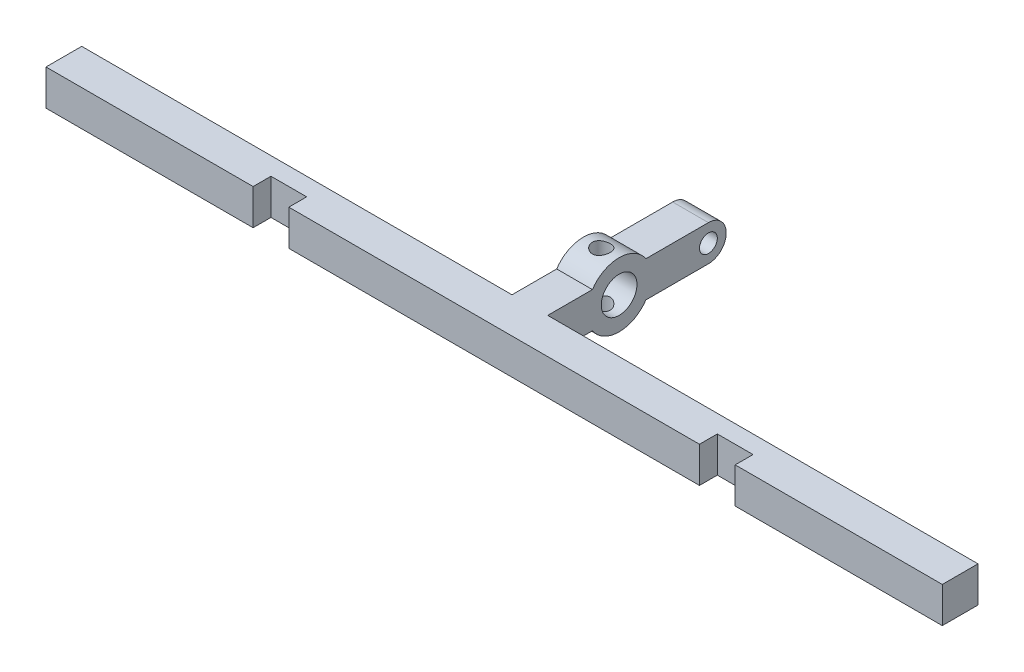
ISO-10303-21;
HEADER;
FILE_DESCRIPTION(('STEP AP214'),'2;1');
FILE_NAME('part.step','',(''),(''),'','','');
FILE_SCHEMA(('AUTOMOTIVE_DESIGN { 1 0 10303 214 1 1 1 1 }'));
ENDSEC;
DATA;
#1=APPLICATION_CONTEXT('core data for automotive mechanical design processes');
#2=APPLICATION_PROTOCOL_DEFINITION('international standard','automotive_design',2000,#1);
#3=PRODUCT_CONTEXT('',#1,'mechanical');
#4=PRODUCT('Part','Part','',(#3));
#5=PRODUCT_RELATED_PRODUCT_CATEGORY('part','',(#4));
#6=PRODUCT_DEFINITION_FORMATION('','',#4);
#7=PRODUCT_DEFINITION_CONTEXT('part definition',#1,'design');
#8=PRODUCT_DEFINITION('design','',#6,#7);
#9=PRODUCT_DEFINITION_SHAPE('','',#8);
#10=(LENGTH_UNIT() NAMED_UNIT(*) SI_UNIT(.MILLI.,.METRE.));
#11=(NAMED_UNIT(*) PLANE_ANGLE_UNIT() SI_UNIT($,.RADIAN.));
#12=(NAMED_UNIT(*) SI_UNIT($,.STERADIAN.) SOLID_ANGLE_UNIT());
#13=UNCERTAINTY_MEASURE_WITH_UNIT(LENGTH_MEASURE(1.E-05),#10,'distance_accuracy_value','');
#14=(GEOMETRIC_REPRESENTATION_CONTEXT(3) GLOBAL_UNCERTAINTY_ASSIGNED_CONTEXT((#13)) GLOBAL_UNIT_ASSIGNED_CONTEXT((#10,
#11,#12)) REPRESENTATION_CONTEXT('',''));
#15=CARTESIAN_POINT('',(0.,0.,0.));
#16=DIRECTION('',(0.,0.,1.));
#17=DIRECTION('',(1.,0.,0.));
#18=AXIS2_PLACEMENT_3D('',#15,#16,#17);
#19=CARTESIAN_POINT('',(-95.0441558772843,4.99999999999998,-20.));
#20=DIRECTION('',(-1.,0.,0.));
#21=DIRECTION('',(0.,0.,1.));
#22=AXIS2_PLACEMENT_3D('',#19,#20,#21);
#23=CYLINDRICAL_SURFACE('',#22,9.);
#24=CARTESIAN_POINT('',(-125.5,-3.64580823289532,-22.5));
#25=CARTESIAN_POINT('',(-125.36251304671,-3.64581037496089,-22.4999971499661));
#26=CARTESIAN_POINT('',(-125.224996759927,-3.64912360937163,-22.4886197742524));
#27=CARTESIAN_POINT('',(-124.953951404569,-3.66197474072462,-22.4435069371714));
#28=CARTESIAN_POINT('',(-124.820424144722,-3.67151541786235,-22.4097614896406));
#29=CARTESIAN_POINT('',(-124.561317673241,-3.6956593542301,-22.3211200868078));
#30=CARTESIAN_POINT('',(-124.435726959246,-3.71025507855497,-22.2662555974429));
#31=CARTESIAN_POINT('',(-124.195509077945,-3.74285475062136,-22.1370337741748));
#32=CARTESIAN_POINT('',(-124.080883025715,-3.760859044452,-22.0626744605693));
#33=CARTESIAN_POINT('',(-123.862738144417,-3.79879482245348,-21.8944153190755));
#34=CARTESIAN_POINT('',(-123.759560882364,-3.81876275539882,-21.8000807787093));
#35=CARTESIAN_POINT('',(-123.570269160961,-3.8580623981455,-21.5954828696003));
#36=CARTESIAN_POINT('',(-123.484156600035,-3.87739403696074,-21.4852177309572));
#37=CARTESIAN_POINT('',(-123.329995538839,-3.91365202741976,-21.249500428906));
#38=CARTESIAN_POINT('',(-123.262289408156,-3.93053038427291,-21.1238163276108));
#39=CARTESIAN_POINT('',(-123.14910072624,-3.95956018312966,-20.8623003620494));
#40=CARTESIAN_POINT('',(-123.103614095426,-3.97171249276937,-20.7264703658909));
#41=CARTESIAN_POINT('',(-123.037269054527,-3.98966318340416,-20.4520863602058));
#42=CARTESIAN_POINT('',(-123.015828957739,-3.99561138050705,-20.313682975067));
#43=CARTESIAN_POINT('',(-122.996352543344,-4.00100867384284,-20.0351244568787));
#44=CARTESIAN_POINT('',(-122.998311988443,-4.00045894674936,-19.8949696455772));
#45=CARTESIAN_POINT('',(-123.025175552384,-3.99303086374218,-19.6209457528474));
#46=CARTESIAN_POINT('',(-123.049450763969,-3.98632598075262,-19.4870095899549));
#47=CARTESIAN_POINT('',(-123.119237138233,-3.96754760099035,-19.2251925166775));
#48=CARTESIAN_POINT('',(-123.164749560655,-3.95547378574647,-19.0973119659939));
#49=CARTESIAN_POINT('',(-123.276182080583,-3.92706250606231,-18.8496664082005));
#50=CARTESIAN_POINT('',(-123.342311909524,-3.91068150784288,-18.7300009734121));
#51=CARTESIAN_POINT('',(-123.49293961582,-3.87541221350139,-18.5032554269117));
#52=CARTESIAN_POINT('',(-123.577441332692,-3.85652339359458,-18.3961779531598));
#53=CARTESIAN_POINT('',(-123.765728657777,-3.81753663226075,-18.1938932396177));
#54=CARTESIAN_POINT('',(-123.870061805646,-3.79741936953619,-18.0991987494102));
#55=CARTESIAN_POINT('',(-124.093332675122,-3.75880383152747,-17.9285189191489));
#56=CARTESIAN_POINT('',(-124.212271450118,-3.74030567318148,-17.8525349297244));
#57=CARTESIAN_POINT('',(-124.462564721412,-3.70694013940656,-17.7209976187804));
#58=CARTESIAN_POINT('',(-124.594002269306,-3.69209980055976,-17.6655949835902));
#59=CARTESIAN_POINT('',(-124.864843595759,-3.6680602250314,-17.5778470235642));
#60=CARTESIAN_POINT('',(-125.00424519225,-3.65885945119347,-17.5454954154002));
#61=CARTESIAN_POINT('',(-125.282234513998,-3.64747148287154,-17.5056754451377));
#62=CARTESIAN_POINT('',(-125.420703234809,-3.64506746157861,-17.4974375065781));
#63=CARTESIAN_POINT('',(-125.697041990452,-3.64694988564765,-17.5039490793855));
#64=CARTESIAN_POINT('',(-125.83491209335,-3.65123554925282,-17.5186959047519));
#65=CARTESIAN_POINT('',(-126.103097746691,-3.66580389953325,-17.5700775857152));
#66=CARTESIAN_POINT('',(-126.233511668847,-3.67595686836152,-17.6062394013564));
#67=CARTESIAN_POINT('',(-126.486420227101,-3.70098664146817,-17.6988874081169));
#68=CARTESIAN_POINT('',(-126.60891376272,-3.7158641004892,-17.7553764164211));
#69=CARTESIAN_POINT('',(-126.845695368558,-3.74910362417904,-17.8886042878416));
#70=CARTESIAN_POINT('',(-126.959721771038,-3.76753959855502,-17.9657893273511));
#71=CARTESIAN_POINT('',(-127.173486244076,-3.80564999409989,-18.1376727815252));
#72=CARTESIAN_POINT('',(-127.273221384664,-3.82532466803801,-18.2323747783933));
#73=CARTESIAN_POINT('',(-127.458821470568,-3.86445019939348,-18.4401825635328));
#74=CARTESIAN_POINT('',(-127.544146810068,-3.88387421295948,-18.5537764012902));
#75=CARTESIAN_POINT('',(-127.694523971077,-3.91967402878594,-18.7941168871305));
#76=CARTESIAN_POINT('',(-127.759576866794,-3.93604999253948,-18.9208628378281));
#77=CARTESIAN_POINT('',(-127.866949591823,-3.96380327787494,-19.1830216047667));
#78=CARTESIAN_POINT('',(-127.909441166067,-3.97521823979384,-19.3183598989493));
#79=CARTESIAN_POINT('',(-127.970968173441,-3.99192942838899,-19.5946236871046));
#80=CARTESIAN_POINT('',(-127.990009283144,-3.99722713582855,-19.7355478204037));
#81=CARTESIAN_POINT('',(-128.003714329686,-4.00103042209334,-20.0139601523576));
#82=CARTESIAN_POINT('',(-127.999166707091,-3.99975568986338,-20.1514070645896));
#83=CARTESIAN_POINT('',(-127.967671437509,-3.99106088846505,-20.4235006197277));
#84=CARTESIAN_POINT('',(-127.94072476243,-3.98364108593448,-20.5581473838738));
#85=CARTESIAN_POINT('',(-127.865656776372,-3.96353984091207,-20.8197849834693));
#86=CARTESIAN_POINT('',(-127.817707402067,-3.95090116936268,-20.9468286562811));
#87=CARTESIAN_POINT('',(-127.702148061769,-3.92167820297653,-21.1911392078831));
#88=CARTESIAN_POINT('',(-127.634535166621,-3.90509332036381,-21.3084046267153));
#89=CARTESIAN_POINT('',(-127.479328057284,-3.8691539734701,-21.533451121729));
#90=CARTESIAN_POINT('',(-127.391219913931,-3.84973411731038,-21.6408672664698));
#91=CARTESIAN_POINT('',(-127.198482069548,-3.81055920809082,-21.8396556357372));
#92=CARTESIAN_POINT('',(-127.093847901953,-3.79080406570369,-21.931023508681));
#93=CARTESIAN_POINT('',(-126.867955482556,-3.75263553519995,-22.097342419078));
#94=CARTESIAN_POINT('',(-126.746353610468,-3.73426670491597,-22.1718379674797));
#95=CARTESIAN_POINT('',(-126.491856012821,-3.70160385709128,-22.2992265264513));
#96=CARTESIAN_POINT('',(-126.35896712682,-3.68730739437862,-22.3521325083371));
#97=CARTESIAN_POINT('',(-126.105639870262,-3.66621345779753,-22.4285949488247));
#98=CARTESIAN_POINT('',(-125.986210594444,-3.65862660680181,-22.4553056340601));
#99=CARTESIAN_POINT('',(-125.744528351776,-3.64842338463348,-22.4910082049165));
#100=CARTESIAN_POINT('',(-125.622275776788,-3.64580632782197,-22.5000025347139));
#101=CARTESIAN_POINT('',(-125.5,-3.64580823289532,-22.5));
#102=B_SPLINE_CURVE_WITH_KNOTS('',3,(#24,#25,#26,#27,#28,#29,#30,#31,#32,#33,#34,#35,#36,#37,
#38,#39,#40,#41,#42,#43,#44,#45,#46,#47,#48,#49,#50,#51,#52,#53,#54,#55,#56,#57,#58,#59,#60,#61,
#62,#63,#64,#65,#66,#67,#68,#69,#70,#71,#72,#73,#74,#75,#76,#77,#78,#79,#80,#81,#82,#83,#84,#85,
#86,#87,#88,#89,#90,#91,#92,#93,#94,#95,#96,#97,#98,#99,#100,#101),.UNSPECIFIED.,.T.,.F.,(4,2,2,
2,2,2,2,2,2,2,2,2,2,2,2,2,2,2,2,2,2,2,2,2,2,2,2,2,2,2,2,2,2,2,2,2,2,2,4),(0.,0.412010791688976,
0.82420564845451,1.23578872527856,1.64741361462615,2.06913895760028,2.49091119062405,
2.92006196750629,3.34913392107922,3.76758631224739,4.1859629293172,4.5928986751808,
4.99985856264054,5.41110133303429,5.82243013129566,6.24742875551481,6.67245804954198,
7.10054057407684,7.52850636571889,7.94265637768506,8.35675799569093,8.76203677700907,
9.1673717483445,9.58226667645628,9.99724654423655,10.4253750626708,10.8534808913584,
11.2782793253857,11.7029749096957,12.1135686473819,12.5241445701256,12.9314203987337,
13.3387569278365,13.7576868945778,14.1767302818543,14.6060087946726,15.0350290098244,
15.4015066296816,15.767933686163),.UNSPECIFIED.);
#103=CARTESIAN_POINT('',(-125.5,-3.64580823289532,-22.5));
#104=VERTEX_POINT('',#103);
#105=EDGE_CURVE('E372',#104,#104,#102,.T.);
#106=ORIENTED_EDGE('',*,*,#105,.F.);
#107=EDGE_LOOP('',(#106));
#108=FACE_BOUND('',#107,.T.);
#109=CARTESIAN_POINT('',(-130.5,4.99999999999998,-20.));
#110=DIRECTION('',(-1.,0.,0.));
#111=DIRECTION('',(0.,0.,1.));
#112=AXIS2_PLACEMENT_3D('',#109,#110,#111);
#113=CIRCLE('',#112,9.);
#114=CARTESIAN_POINT('',(-130.5,0.,-27.4833147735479));
#115=VERTEX_POINT('',#114);
#116=CARTESIAN_POINT('',(-130.5,0.,-12.5166852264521));
#117=VERTEX_POINT('',#116);
#118=EDGE_CURVE('E211',#115,#117,#113,.T.);
#119=ORIENTED_EDGE('',*,*,#118,.F.);
#120=DIRECTION('',(-1.,0.,0.));
#121=VECTOR('',#120,1.);
#122=CARTESIAN_POINT('',(-95.0441558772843,0.,-27.4833147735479));
#123=LINE('',#122,#121);
#124=CARTESIAN_POINT('',(-120.5,0.,-27.4833147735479));
#125=VERTEX_POINT('',#124);
#126=EDGE_CURVE('E200',#115,#125,#123,.F.);
#127=ORIENTED_EDGE('',*,*,#126,.T.);
#128=CARTESIAN_POINT('',(-120.5,4.99999999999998,-20.));
#129=DIRECTION('',(-1.,0.,0.));
#130=DIRECTION('',(0.,-1.,0.));
#131=AXIS2_PLACEMENT_3D('',#128,#129,#130);
#132=CIRCLE('',#131,9.);
#133=CARTESIAN_POINT('',(-120.5,0.,-12.5166852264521));
#134=VERTEX_POINT('',#133);
#135=EDGE_CURVE('E206',#134,#125,#132,.F.);
#136=ORIENTED_EDGE('',*,*,#135,.F.);
#137=DIRECTION('',(-1.,0.,0.));
#138=VECTOR('',#137,1.);
#139=CARTESIAN_POINT('',(-95.0441558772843,0.,-12.5166852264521));
#140=LINE('',#139,#138);
#141=EDGE_CURVE('E210',#117,#134,#140,.F.);
#142=ORIENTED_EDGE('',*,*,#141,.F.);
#143=EDGE_LOOP('',(#119,#127,#136,#142));
#144=FACE_BOUND('',#143,.T.);
#145=ADVANCED_FACE('F41',(#108,#144),#23,.T.);
#146=CARTESIAN_POINT('',(-128.,14.0000000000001,-20.0000000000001));
#147=CARTESIAN_POINT('',(-127.99999720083,13.9999981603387,-19.8623974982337));
#148=CARTESIAN_POINT('',(-127.988601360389,13.9968134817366,-19.7247657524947));
#149=CARTESIAN_POINT('',(-127.943408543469,13.9844190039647,-19.4534810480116));
#150=CARTESIAN_POINT('',(-127.909602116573,13.9752066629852,-19.3198297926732));
#151=CARTESIAN_POINT('',(-127.820782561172,13.9517713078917,-19.0604601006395));
#152=CARTESIAN_POINT('',(-127.765798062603,13.9375550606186,-18.9347312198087));
#153=CARTESIAN_POINT('',(-127.636292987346,13.9056062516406,-18.6942786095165));
#154=CARTESIAN_POINT('',(-127.561770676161,13.8878733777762,-18.5795558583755));
#155=CARTESIAN_POINT('',(-127.393341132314,13.8503031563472,-18.3615064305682));
#156=CARTESIAN_POINT('',(-127.299035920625,13.8304274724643,-18.2584937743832));
#157=CARTESIAN_POINT('',(-127.094567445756,13.7910521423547,-18.0695236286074));
#158=CARTESIAN_POINT('',(-126.984401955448,13.7715525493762,-17.9835685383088));
#159=CARTESIAN_POINT('',(-126.748785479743,13.7347408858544,-17.8295838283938));
#160=CARTESIAN_POINT('',(-126.623085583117,13.717476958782,-17.761922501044));
#161=CARTESIAN_POINT('',(-126.361536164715,13.6876580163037,-17.6488208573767));
#162=CARTESIAN_POINT('',(-126.225688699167,13.675102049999,-17.603376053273));
#163=CARTESIAN_POINT('',(-125.951194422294,13.6565176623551,-17.5371015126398));
#164=CARTESIAN_POINT('',(-125.812696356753,13.6503377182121,-17.515699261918));
#165=CARTESIAN_POINT('',(-125.533948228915,13.644752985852,-17.4963314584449));
#166=CARTESIAN_POINT('',(-125.393698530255,13.645346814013,-17.4983611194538));
#167=CARTESIAN_POINT('',(-125.119955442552,13.6531073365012,-17.5253465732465));
#168=CARTESIAN_POINT('',(-124.986386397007,13.6600732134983,-17.5496019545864));
#169=CARTESIAN_POINT('',(-124.725292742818,13.6794703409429,-17.6192253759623));
#170=CARTESIAN_POINT('',(-124.597768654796,13.6919020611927,-17.664595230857));
#171=CARTESIAN_POINT('',(-124.350595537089,13.7210013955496,-17.7757125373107));
#172=CARTESIAN_POINT('',(-124.23106026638,13.7377183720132,-17.8416995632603));
#173=CARTESIAN_POINT('',(-124.004516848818,13.7734790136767,-17.9920111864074));
#174=CARTESIAN_POINT('',(-123.897511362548,13.7925231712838,-18.0763396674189));
#175=CARTESIAN_POINT('',(-123.695072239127,13.8316214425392,-18.2644887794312));
#176=CARTESIAN_POINT('',(-123.60018473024,13.8516874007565,-18.3688954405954));
#177=CARTESIAN_POINT('',(-123.429148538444,13.8899639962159,-18.592386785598));
#178=CARTESIAN_POINT('',(-123.353000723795,13.908174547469,-18.7114721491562));
#179=CARTESIAN_POINT('',(-123.22133636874,13.9408167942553,-18.9618331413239));
#180=CARTESIAN_POINT('',(-123.165925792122,13.9552289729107,-19.0931672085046));
#181=CARTESIAN_POINT('',(-123.078131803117,13.9785098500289,-19.3637800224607));
#182=CARTESIAN_POINT('',(-123.045742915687,13.987379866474,-19.5030568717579));
#183=CARTESIAN_POINT('',(-123.005785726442,13.9983747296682,-19.7809467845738));
#184=CARTESIAN_POINT('',(-122.997475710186,14.0007010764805,-19.9194453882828));
#185=CARTESIAN_POINT('',(-123.003853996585,13.9989296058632,-20.1958598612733));
#186=CARTESIAN_POINT('',(-123.018539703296,13.9948325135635,-20.3337757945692));
#187=CARTESIAN_POINT('',(-123.069886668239,13.9808053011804,-20.6024138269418));
#188=CARTESIAN_POINT('',(-123.106127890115,13.970986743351,-20.7332225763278));
#189=CARTESIAN_POINT('',(-123.199063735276,13.9466365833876,-20.9868862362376));
#190=CARTESIAN_POINT('',(-123.255760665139,13.9321044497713,-21.1097402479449));
#191=CARTESIAN_POINT('',(-123.389331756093,13.8994748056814,-21.3468402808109));
#192=CARTESIAN_POINT('',(-123.466601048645,13.8813094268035,-21.460854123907));
#193=CARTESIAN_POINT('',(-123.638632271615,13.843509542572,-21.6745553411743));
#194=CARTESIAN_POINT('',(-123.733397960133,13.8238747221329,-21.7742396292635));
#195=CARTESIAN_POINT('',(-123.941202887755,13.7845968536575,-21.9596240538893));
#196=CARTESIAN_POINT('',(-124.054714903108,13.7649721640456,-22.0447991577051));
#197=CARTESIAN_POINT('',(-124.294841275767,13.7285938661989,-22.1949116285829));
#198=CARTESIAN_POINT('',(-124.421455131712,13.7118401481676,-22.2598497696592));
#199=CARTESIAN_POINT('',(-124.683614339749,13.6832959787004,-22.3671621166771));
#200=CARTESIAN_POINT('',(-124.819105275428,13.6714780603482,-22.4096615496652));
#201=CARTESIAN_POINT('',(-125.095699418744,13.6541575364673,-22.4711530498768));
#202=CARTESIAN_POINT('',(-125.236801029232,13.6486531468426,-22.4901517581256));
#203=CARTESIAN_POINT('',(-125.515211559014,13.6447407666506,-22.5036971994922));
#204=CARTESIAN_POINT('',(-125.652476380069,13.646086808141,-22.4990914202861));
#205=CARTESIAN_POINT('',(-125.924189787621,13.6551427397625,-22.4675428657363));
#206=CARTESIAN_POINT('',(-126.058638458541,13.6628524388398,-22.4406007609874));
#207=CARTESIAN_POINT('',(-126.319734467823,13.6836143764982,-22.3656544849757));
#208=CARTESIAN_POINT('',(-126.446441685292,13.6966173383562,-22.3178442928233));
#209=CARTESIAN_POINT('',(-126.690134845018,13.7264983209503,-22.2026690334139));
#210=CARTESIAN_POINT('',(-126.807119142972,13.7433769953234,-22.1353006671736));
#211=CARTESIAN_POINT('',(-127.032055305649,13.779776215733,-21.9804139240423));
#212=CARTESIAN_POINT('',(-127.139602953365,13.799363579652,-21.8923241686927));
#213=CARTESIAN_POINT('',(-127.338664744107,13.8386166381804,-21.6995630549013));
#214=CARTESIAN_POINT('',(-127.430174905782,13.8582823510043,-21.5948875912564));
#215=CARTESIAN_POINT('',(-127.596716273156,13.8960367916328,-21.3689204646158));
#216=CARTESIAN_POINT('',(-127.671303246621,13.9140768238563,-21.2472925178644));
#217=CARTESIAN_POINT('',(-127.798856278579,13.9459994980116,-20.9927239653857));
#218=CARTESIAN_POINT('',(-127.851835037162,13.9598845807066,-20.8597900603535));
#219=CARTESIAN_POINT('',(-127.928440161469,13.9803214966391,-20.6062909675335));
#220=CARTESIAN_POINT('',(-127.955209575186,13.9876449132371,-20.4867288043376));
#221=CARTESIAN_POINT('',(-127.990989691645,13.9974846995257,-20.2447852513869));
#222=CARTESIAN_POINT('',(-128.00000249,14.0000016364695,-20.1224041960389));
#223=CARTESIAN_POINT('',(-128.,14.0000000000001,-20.0000000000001));
#224=B_SPLINE_CURVE_WITH_KNOTS('',3,(#146,#147,#148,#149,#150,#151,#152,#153,#154,#155,#156,
#157,#158,#159,#160,#161,#162,#163,#164,#165,#166,#167,#168,#169,#170,#171,#172,#173,#174,#175,
#176,#177,#178,#179,#180,#181,#182,#183,#184,#185,#186,#187,#188,#189,#190,#191,#192,#193,#194,
#195,#196,#197,#198,#199,#200,#201,#202,#203,#204,#205,#206,#207,#208,#209,#210,#211,#212,#213,
#214,#215,#216,#217,#218,#219,#220,#221,#222,#223),.UNSPECIFIED.,.T.,.F.,(4,2,2,2,2,2,2,2,2,2,2,
2,2,2,2,2,2,2,2,2,2,2,2,2,2,2,2,2,2,2,2,2,2,2,2,2,2,2,4),(0.,0.412358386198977,
0.824890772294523,1.23686741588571,1.64888064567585,2.0701524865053,2.49148354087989,
2.92075380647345,3.34993732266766,3.76866863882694,4.18731442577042,4.59320465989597,
4.99912978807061,5.40995920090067,5.82087569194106,6.24638987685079,6.67192377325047,
7.09960331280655,7.5271811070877,7.94144021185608,8.3556525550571,8.76204634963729,
9.16848598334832,9.58337897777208,9.99836119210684,10.4261198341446,10.8538621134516,
11.279191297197,11.7044002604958,12.114451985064,12.5244913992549,12.9307978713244,
13.3371729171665,13.7564382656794,14.1758075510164,14.6051618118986,15.0342633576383,
15.4011197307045,15.7679328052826),.UNSPECIFIED.);
#225=CARTESIAN_POINT('',(-128.,14.0000000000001,-20.0000000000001));
#226=VERTEX_POINT('',#225);
#227=EDGE_CURVE('E365',#226,#226,#224,.T.);
#228=ORIENTED_EDGE('',*,*,#227,.F.);
#229=EDGE_LOOP('',(#228));
#230=FACE_BOUND('',#229,.T.);
#231=CARTESIAN_POINT('',(-120.5,9.99999999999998,-27.4833147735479));
#232=VERTEX_POINT('',#231);
#233=CARTESIAN_POINT('',(-120.5,9.99999999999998,-12.5166852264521));
#234=VERTEX_POINT('',#233);
#235=EDGE_CURVE('E188',#232,#234,#132,.F.);
#236=ORIENTED_EDGE('',*,*,#235,.F.);
#237=DIRECTION('',(-1.,0.,0.));
#238=VECTOR('',#237,1.);
#239=CARTESIAN_POINT('',(-95.0441558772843,9.99999999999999,-27.4833147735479));
#240=LINE('',#239,#238);
#241=CARTESIAN_POINT('',(-130.5,9.99999999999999,-27.4833147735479));
#242=VERTEX_POINT('',#241);
#243=EDGE_CURVE('E196',#232,#242,#240,.T.);
#244=ORIENTED_EDGE('',*,*,#243,.T.);
#245=CARTESIAN_POINT('',(-130.5,9.99999999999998,-12.5166852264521));
#246=VERTEX_POINT('',#245);
#247=EDGE_CURVE('E207',#246,#242,#113,.T.);
#248=ORIENTED_EDGE('',*,*,#247,.F.);
#249=DIRECTION('',(-1.,0.,0.));
#250=VECTOR('',#249,1.);
#251=CARTESIAN_POINT('',(-95.0441558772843,9.99999999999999,-12.5166852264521));
#252=LINE('',#251,#250);
#253=EDGE_CURVE('E201',#234,#246,#252,.T.);
#254=ORIENTED_EDGE('',*,*,#253,.F.);
#255=EDGE_LOOP('',(#236,#244,#248,#254));
#256=FACE_BOUND('',#255,.T.);
#257=ADVANCED_FACE('F203',(#230,#256),#23,.T.);
#258=CARTESIAN_POINT('',(0.,0.,10.));
#259=DIRECTION('',(0.,1.,0.));
#260=DIRECTION('',(-1.,0.,0.));
#261=AXIS2_PLACEMENT_3D('',#258,#259,#260);
#262=PLANE('',#261);
#263=DIRECTION('',(0.,0.,1.));
#264=VECTOR('',#263,1.);
#265=CARTESIAN_POINT('',(-130.5,0.,-40.));
#266=LINE('',#265,#264);
#267=CARTESIAN_POINT('',(-130.5,0.,0.));
#268=VERTEX_POINT('',#267);
#269=EDGE_CURVE('E245',#117,#268,#266,.T.);
#270=ORIENTED_EDGE('',*,*,#269,.F.);
#271=ORIENTED_EDGE('',*,*,#141,.T.);
#272=DIRECTION('',(0.,0.,1.));
#273=VECTOR('',#272,1.);
#274=CARTESIAN_POINT('',(-120.5,0.,-40.));
#275=LINE('',#274,#273);
#276=CARTESIAN_POINT('',(-120.5,0.,0.));
#277=VERTEX_POINT('',#276);
#278=EDGE_CURVE('E217',#134,#277,#275,.T.);
#279=ORIENTED_EDGE('',*,*,#278,.T.);
#280=DIRECTION('',(1.,0.,0.));
#281=VECTOR('',#280,1.);
#282=CARTESIAN_POINT('',(0.,0.,0.));
#283=LINE('',#282,#281);
#284=CARTESIAN_POINT('',(0.,0.,0.));
#285=VERTEX_POINT('',#284);
#286=EDGE_CURVE('E246',#277,#285,#283,.T.);
#287=ORIENTED_EDGE('',*,*,#286,.T.);
#288=DIRECTION('',(0.,0.,-1.));
#289=VECTOR('',#288,1.);
#290=CARTESIAN_POINT('',(0.,0.,10.));
#291=LINE('',#290,#289);
#292=CARTESIAN_POINT('',(0.,0.,10.));
#293=VERTEX_POINT('',#292);
#294=EDGE_CURVE('E238',#293,#285,#291,.T.);
#295=ORIENTED_EDGE('',*,*,#294,.F.);
#296=DIRECTION('',(1.,0.,0.));
#297=VECTOR('',#296,1.);
#298=CARTESIAN_POINT('',(0.,0.,10.));
#299=LINE('',#298,#297);
#300=CARTESIAN_POINT('',(-58.,0.,10.));
#301=VERTEX_POINT('',#300);
#302=EDGE_CURVE('E257',#301,#293,#299,.T.);
#303=ORIENTED_EDGE('',*,*,#302,.F.);
#304=DIRECTION('',(0.,0.,1.));
#305=VECTOR('',#304,1.);
#306=CARTESIAN_POINT('',(-58.,0.,5.));
#307=LINE('',#306,#305);
#308=CARTESIAN_POINT('',(-58.,0.,5.));
#309=VERTEX_POINT('',#308);
#310=EDGE_CURVE('E277',#309,#301,#307,.T.);
#311=ORIENTED_EDGE('',*,*,#310,.F.);
#312=DIRECTION('',(1.,0.,0.));
#313=VECTOR('',#312,1.);
#314=CARTESIAN_POINT('',(-58.,0.,5.));
#315=LINE('',#314,#313);
#316=CARTESIAN_POINT('',(-68.,0.,5.));
#317=VERTEX_POINT('',#316);
#318=EDGE_CURVE('E282',#317,#309,#315,.T.);
#319=ORIENTED_EDGE('',*,*,#318,.F.);
#320=DIRECTION('',(0.,0.,1.));
#321=VECTOR('',#320,1.);
#322=CARTESIAN_POINT('',(-68.,0.,5.));
#323=LINE('',#322,#321);
#324=CARTESIAN_POINT('',(-68.,0.,10.));
#325=VERTEX_POINT('',#324);
#326=EDGE_CURVE('E274',#317,#325,#323,.T.);
#327=ORIENTED_EDGE('',*,*,#326,.T.);
#328=CARTESIAN_POINT('',(-183.,0.,10.));
#329=VERTEX_POINT('',#328);
#330=EDGE_CURVE('E231',#329,#325,#299,.T.);
#331=ORIENTED_EDGE('',*,*,#330,.F.);
#332=DIRECTION('',(0.,0.,1.));
#333=VECTOR('',#332,1.);
#334=CARTESIAN_POINT('',(-183.,0.,5.));
#335=LINE('',#334,#333);
#336=CARTESIAN_POINT('',(-183.,0.,5.));
#337=VERTEX_POINT('',#336);
#338=EDGE_CURVE('E296',#337,#329,#335,.T.);
#339=ORIENTED_EDGE('',*,*,#338,.F.);
#340=DIRECTION('',(1.,0.,0.));
#341=VECTOR('',#340,1.);
#342=CARTESIAN_POINT('',(-193.,0.,5.));
#343=LINE('',#342,#341);
#344=CARTESIAN_POINT('',(-193.,0.,5.));
#345=VERTEX_POINT('',#344);
#346=EDGE_CURVE('E313',#345,#337,#343,.T.);
#347=ORIENTED_EDGE('',*,*,#346,.F.);
#348=DIRECTION('',(0.,0.,1.));
#349=VECTOR('',#348,1.);
#350=CARTESIAN_POINT('',(-193.,0.,5.));
#351=LINE('',#350,#349);
#352=CARTESIAN_POINT('',(-193.,0.,10.));
#353=VERTEX_POINT('',#352);
#354=EDGE_CURVE('E237',#345,#353,#351,.T.);
#355=ORIENTED_EDGE('',*,*,#354,.T.);
#356=CARTESIAN_POINT('',(-251.,0.,10.));
#357=VERTEX_POINT('',#356);
#358=EDGE_CURVE('E254',#357,#353,#299,.T.);
#359=ORIENTED_EDGE('',*,*,#358,.F.);
#360=DIRECTION('',(0.,0.,-1.));
#361=VECTOR('',#360,1.);
#362=CARTESIAN_POINT('',(-251.,0.,10.));
#363=LINE('',#362,#361);
#364=CARTESIAN_POINT('',(-251.,0.,0.));
#365=VERTEX_POINT('',#364);
#366=EDGE_CURVE('E233',#357,#365,#363,.T.);
#367=ORIENTED_EDGE('',*,*,#366,.T.);
#368=EDGE_CURVE('E236',#365,#268,#283,.T.);
#369=ORIENTED_EDGE('',*,*,#368,.T.);
#370=EDGE_LOOP('',(#270,#271,#279,#287,#295,#303,#311,#319,#327,#331,#339,#347,#355,#359,#367,#369));
#371=FACE_BOUND('',#370,.T.);
#372=ADVANCED_FACE('F431',(#371),#262,.F.);
#373=CARTESIAN_POINT('',(-130.5,0.,-40.));
#374=DIRECTION('',(1.,0.,0.));
#375=DIRECTION('',(0.,0.,-1.));
#376=AXIS2_PLACEMENT_3D('',#373,#374,#375);
#377=PLANE('',#376);
#378=CARTESIAN_POINT('',(-130.5,4.99999999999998,-20.));
#379=DIRECTION('',(-1.,0.,0.));
#380=DIRECTION('',(0.,0.,1.));
#381=AXIS2_PLACEMENT_3D('',#378,#379,#380);
#382=CIRCLE('',#381,5.);
#383=CARTESIAN_POINT('',(-130.5,4.99999999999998,-15.));
#384=VERTEX_POINT('',#383);
#385=EDGE_CURVE('E309',#384,#384,#382,.T.);
#386=ORIENTED_EDGE('',*,*,#385,.F.);
#387=EDGE_LOOP('',(#386));
#388=FACE_BOUND('',#387,.T.);
#389=CARTESIAN_POINT('',(-130.5,4.99999999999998,-45.));
#390=DIRECTION('',(1.,0.,0.));
#391=DIRECTION('',(0.,0.,-1.));
#392=AXIS2_PLACEMENT_3D('',#389,#390,#391);
#393=CIRCLE('',#392,5.);
#394=CARTESIAN_POINT('',(-130.5,9.99999999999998,-45.));
#395=VERTEX_POINT('',#394);
#396=CARTESIAN_POINT('',(-130.5,4.99999999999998,-50.));
#397=VERTEX_POINT('',#396);
#398=EDGE_CURVE('E57',#395,#397,#393,.F.);
#399=ORIENTED_EDGE('',*,*,#398,.T.);
#400=CARTESIAN_POINT('',(-130.5,4.99999999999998,-45.));
#401=DIRECTION('',(1.,0.,0.));
#402=DIRECTION('',(0.,0.,-1.));
#403=AXIS2_PLACEMENT_3D('',#400,#401,#402);
#404=CIRCLE('',#403,5.);
#405=CARTESIAN_POINT('',(-130.5,0.,-45.));
#406=VERTEX_POINT('',#405);
#407=EDGE_CURVE('E50',#397,#406,#404,.F.);
#408=ORIENTED_EDGE('',*,*,#407,.T.);
#409=DIRECTION('',(0.,0.,1.));
#410=VECTOR('',#409,1.);
#411=CARTESIAN_POINT('',(-130.5,0.,-40.));
#412=LINE('',#411,#410);
#413=EDGE_CURVE('E487',#406,#115,#412,.T.);
#414=ORIENTED_EDGE('',*,*,#413,.T.);
#415=ORIENTED_EDGE('',*,*,#118,.T.);
#416=ORIENTED_EDGE('',*,*,#269,.T.);
#417=DIRECTION('',(0.,1.,0.));
#418=VECTOR('',#417,1.);
#419=CARTESIAN_POINT('',(-130.5,0.,0.));
#420=LINE('',#419,#418);
#421=CARTESIAN_POINT('',(-130.5,9.99999999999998,0.));
#422=VERTEX_POINT('',#421);
#423=EDGE_CURVE('E222',#268,#422,#420,.T.);
#424=ORIENTED_EDGE('',*,*,#423,.T.);
#425=DIRECTION('',(0.,0.,1.));
#426=VECTOR('',#425,1.);
#427=CARTESIAN_POINT('',(-130.5,9.99999999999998,-40.));
#428=LINE('',#427,#426);
#429=EDGE_CURVE('E241',#246,#422,#428,.T.);
#430=ORIENTED_EDGE('',*,*,#429,.F.);
#431=ORIENTED_EDGE('',*,*,#247,.T.);
#432=DIRECTION('',(0.,0.,1.));
#433=VECTOR('',#432,1.);
#434=CARTESIAN_POINT('',(-130.5,9.99999999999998,-40.));
#435=LINE('',#434,#433);
#436=EDGE_CURVE('E192',#395,#242,#435,.T.);
#437=ORIENTED_EDGE('',*,*,#436,.F.);
#438=EDGE_LOOP('',(#399,#408,#414,#415,#416,#424,#430,#431,#437));
#439=FACE_BOUND('',#438,.T.);
#440=CARTESIAN_POINT('',(-130.5,5.00000000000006,-45.));
#441=DIRECTION('',(1.,0.,0.));
#442=DIRECTION('',(0.,1.,0.));
#443=AXIS2_PLACEMENT_3D('',#440,#441,#442);
#444=CIRCLE('',#443,2.5);
#445=CARTESIAN_POINT('',(-130.5,7.50000000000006,-45.));
#446=VERTEX_POINT('',#445);
#447=EDGE_CURVE('E342',#446,#446,#444,.T.);
#448=ORIENTED_EDGE('',*,*,#447,.T.);
#449=EDGE_LOOP('',(#448));
#450=FACE_BOUND('',#449,.T.);
#451=ADVANCED_FACE('F428',(#388,#439,#450),#377,.F.);
#452=CARTESIAN_POINT('',(-120.5,0.,-40.));
#453=DIRECTION('',(-1.,0.,0.));
#454=DIRECTION('',(0.,-1.,0.));
#455=AXIS2_PLACEMENT_3D('',#452,#453,#454);
#456=PLANE('',#455);
#457=DIRECTION('',(0.,0.,1.));
#458=VECTOR('',#457,1.);
#459=CARTESIAN_POINT('',(-120.5,0.,-40.));
#460=LINE('',#459,#458);
#461=CARTESIAN_POINT('',(-120.5,0.,-45.));
#462=VERTEX_POINT('',#461);
#463=EDGE_CURVE('E193',#462,#125,#460,.T.);
#464=ORIENTED_EDGE('',*,*,#463,.F.);
#465=CARTESIAN_POINT('',(-120.5,4.99999999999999,-45.));
#466=DIRECTION('',(-1.,0.,0.));
#467=DIRECTION('',(0.,-1.,0.));
#468=AXIS2_PLACEMENT_3D('',#465,#466,#467);
#469=CIRCLE('',#468,5.);
#470=CARTESIAN_POINT('',(-120.5,4.99999999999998,-50.));
#471=VERTEX_POINT('',#470);
#472=EDGE_CURVE('E484',#462,#471,#469,.F.);
#473=ORIENTED_EDGE('',*,*,#472,.T.);
#474=CARTESIAN_POINT('',(-120.5,4.99999999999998,-45.));
#475=DIRECTION('',(-1.,0.,0.));
#476=DIRECTION('',(0.,-1.,0.));
#477=AXIS2_PLACEMENT_3D('',#474,#475,#476);
#478=CIRCLE('',#477,5.);
#479=CARTESIAN_POINT('',(-120.5,9.99999999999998,-45.));
#480=VERTEX_POINT('',#479);
#481=EDGE_CURVE('E191',#471,#480,#478,.F.);
#482=ORIENTED_EDGE('',*,*,#481,.T.);
#483=DIRECTION('',(0.,0.,1.));
#484=VECTOR('',#483,1.);
#485=CARTESIAN_POINT('',(-120.5,9.99999999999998,-40.));
#486=LINE('',#485,#484);
#487=EDGE_CURVE('E182',#480,#232,#486,.T.);
#488=ORIENTED_EDGE('',*,*,#487,.T.);
#489=ORIENTED_EDGE('',*,*,#235,.T.);
#490=DIRECTION('',(0.,0.,1.));
#491=VECTOR('',#490,1.);
#492=CARTESIAN_POINT('',(-120.5,9.99999999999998,-40.));
#493=LINE('',#492,#491);
#494=CARTESIAN_POINT('',(-120.5,9.99999999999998,0.));
#495=VERTEX_POINT('',#494);
#496=EDGE_CURVE('E221',#234,#495,#493,.T.);
#497=ORIENTED_EDGE('',*,*,#496,.T.);
#498=DIRECTION('',(0.,-1.,0.));
#499=VECTOR('',#498,1.);
#500=CARTESIAN_POINT('',(-120.5,0.,0.));
#501=LINE('',#500,#499);
#502=EDGE_CURVE('E318',#495,#277,#501,.T.);
#503=ORIENTED_EDGE('',*,*,#502,.T.);
#504=ORIENTED_EDGE('',*,*,#278,.F.);
#505=ORIENTED_EDGE('',*,*,#135,.T.);
#506=EDGE_LOOP('',(#464,#473,#482,#488,#489,#497,#503,#504,#505));
#507=FACE_BOUND('',#506,.T.);
#508=CARTESIAN_POINT('',(-120.5,4.99999999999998,-20.));
#509=DIRECTION('',(-1.,0.,0.));
#510=DIRECTION('',(0.,-1.,0.));
#511=AXIS2_PLACEMENT_3D('',#508,#509,#510);
#512=CIRCLE('',#511,5.);
#513=CARTESIAN_POINT('',(-120.5,0.,-20.));
#514=VERTEX_POINT('',#513);
#515=EDGE_CURVE('E218',#514,#514,#512,.T.);
#516=ORIENTED_EDGE('',*,*,#515,.T.);
#517=EDGE_LOOP('',(#516));
#518=FACE_BOUND('',#517,.T.);
#519=CARTESIAN_POINT('',(-120.5,5.00000000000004,-45.));
#520=DIRECTION('',(1.,0.,0.));
#521=DIRECTION('',(0.,1.,0.));
#522=AXIS2_PLACEMENT_3D('',#519,#520,#521);
#523=CIRCLE('',#522,2.5);
#524=CARTESIAN_POINT('',(-120.5,7.50000000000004,-45.));
#525=VERTEX_POINT('',#524);
#526=EDGE_CURVE('E373',#525,#525,#523,.T.);
#527=ORIENTED_EDGE('',*,*,#526,.F.);
#528=EDGE_LOOP('',(#527));
#529=FACE_BOUND('',#528,.T.);
#530=ADVANCED_FACE('F185',(#507,#518,#529),#456,.F.);
#531=CARTESIAN_POINT('',(0.,0.,0.));
#532=DIRECTION('',(0.,0.,1.));
#533=DIRECTION('',(1.,0.,0.));
#534=AXIS2_PLACEMENT_3D('',#531,#532,#533);
#535=PLANE('',#534);
#536=ORIENTED_EDGE('',*,*,#423,.F.);
#537=ORIENTED_EDGE('',*,*,#368,.F.);
#538=DIRECTION('',(0.,-1.,0.));
#539=VECTOR('',#538,1.);
#540=CARTESIAN_POINT('',(-251.,0.,0.));
#541=LINE('',#540,#539);
#542=CARTESIAN_POINT('',(-251.,9.99999999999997,0.));
#543=VERTEX_POINT('',#542);
#544=EDGE_CURVE('E232',#543,#365,#541,.T.);
#545=ORIENTED_EDGE('',*,*,#544,.F.);
#546=DIRECTION('',(-1.,0.,0.));
#547=VECTOR('',#546,1.);
#548=CARTESIAN_POINT('',(0.,10.,0.));
#549=LINE('',#548,#547);
#550=EDGE_CURVE('E250',#422,#543,#549,.T.);
#551=ORIENTED_EDGE('',*,*,#550,.F.);
#552=EDGE_LOOP('',(#536,#537,#545,#551));
#553=FACE_BOUND('',#552,.T.);
#554=ADVANCED_FACE('F395',(#553),#535,.F.);
#555=ORIENTED_EDGE('',*,*,#502,.F.);
#556=CARTESIAN_POINT('',(0.,10.,0.));
#557=VERTEX_POINT('',#556);
#558=EDGE_CURVE('E226',#557,#495,#549,.T.);
#559=ORIENTED_EDGE('',*,*,#558,.F.);
#560=DIRECTION('',(0.,1.,0.));
#561=VECTOR('',#560,1.);
#562=CARTESIAN_POINT('',(0.,0.,0.));
#563=LINE('',#562,#561);
#564=EDGE_CURVE('E242',#285,#557,#563,.T.);
#565=ORIENTED_EDGE('',*,*,#564,.F.);
#566=ORIENTED_EDGE('',*,*,#286,.F.);
#567=EDGE_LOOP('',(#555,#559,#565,#566));
#568=FACE_BOUND('',#567,.T.);
#569=ADVANCED_FACE('F398',(#568),#535,.F.);
#570=CARTESIAN_POINT('',(0.,0.,10.));
#571=DIRECTION('',(0.,0.,1.));
#572=DIRECTION('',(1.,0.,0.));
#573=AXIS2_PLACEMENT_3D('',#570,#571,#572);
#574=PLANE('',#573);
#575=DIRECTION('',(0.,-1.,0.));
#576=VECTOR('',#575,1.);
#577=CARTESIAN_POINT('',(-193.,10.,10.));
#578=LINE('',#577,#576);
#579=CARTESIAN_POINT('',(-193.,10.,10.));
#580=VERTEX_POINT('',#579);
#581=EDGE_CURVE('E285',#580,#353,#578,.T.);
#582=ORIENTED_EDGE('',*,*,#581,.F.);
#583=DIRECTION('',(-1.,0.,0.));
#584=VECTOR('',#583,1.);
#585=CARTESIAN_POINT('',(0.,10.,10.));
#586=LINE('',#585,#584);
#587=CARTESIAN_POINT('',(-251.,9.99999999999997,10.));
#588=VERTEX_POINT('',#587);
#589=EDGE_CURVE('E260',#580,#588,#586,.T.);
#590=ORIENTED_EDGE('',*,*,#589,.T.);
#591=DIRECTION('',(0.,-1.,0.));
#592=VECTOR('',#591,1.);
#593=CARTESIAN_POINT('',(-251.,0.,10.));
#594=LINE('',#593,#592);
#595=EDGE_CURVE('E258',#588,#357,#594,.T.);
#596=ORIENTED_EDGE('',*,*,#595,.T.);
#597=ORIENTED_EDGE('',*,*,#358,.T.);
#598=EDGE_LOOP('',(#582,#590,#596,#597));
#599=FACE_BOUND('',#598,.T.);
#600=ADVANCED_FACE('F404',(#599),#574,.T.);
#601=DIRECTION('',(0.,1.,0.));
#602=VECTOR('',#601,1.);
#603=CARTESIAN_POINT('',(-58.,10.,10.));
#604=LINE('',#603,#602);
#605=CARTESIAN_POINT('',(-58.,10.,10.));
#606=VERTEX_POINT('',#605);
#607=EDGE_CURVE('E279',#301,#606,#604,.T.);
#608=ORIENTED_EDGE('',*,*,#607,.F.);
#609=ORIENTED_EDGE('',*,*,#302,.T.);
#610=DIRECTION('',(0.,1.,0.));
#611=VECTOR('',#610,1.);
#612=CARTESIAN_POINT('',(0.,0.,10.));
#613=LINE('',#612,#611);
#614=CARTESIAN_POINT('',(0.,10.,10.));
#615=VERTEX_POINT('',#614);
#616=EDGE_CURVE('E263',#293,#615,#613,.T.);
#617=ORIENTED_EDGE('',*,*,#616,.T.);
#618=EDGE_CURVE('E253',#615,#606,#586,.T.);
#619=ORIENTED_EDGE('',*,*,#618,.T.);
#620=EDGE_LOOP('',(#608,#609,#617,#619));
#621=FACE_BOUND('',#620,.T.);
#622=ADVANCED_FACE('F388',(#621),#574,.T.);
#623=CARTESIAN_POINT('',(0.,0.,10.));
#624=DIRECTION('',(-1.,0.,0.));
#625=DIRECTION('',(0.,0.,1.));
#626=AXIS2_PLACEMENT_3D('',#623,#624,#625);
#627=PLANE('',#626);
#628=ORIENTED_EDGE('',*,*,#564,.T.);
#629=DIRECTION('',(0.,0.,-1.));
#630=VECTOR('',#629,1.);
#631=CARTESIAN_POINT('',(0.,10.,10.));
#632=LINE('',#631,#630);
#633=EDGE_CURVE('E223',#615,#557,#632,.T.);
#634=ORIENTED_EDGE('',*,*,#633,.F.);
#635=ORIENTED_EDGE('',*,*,#616,.F.);
#636=ORIENTED_EDGE('',*,*,#294,.T.);
#637=EDGE_LOOP('',(#628,#634,#635,#636));
#638=FACE_BOUND('',#637,.T.);
#639=ADVANCED_FACE('F383',(#638),#627,.F.);
#640=CARTESIAN_POINT('',(0.,10.,10.));
#641=DIRECTION('',(0.,-1.,0.));
#642=DIRECTION('',(1.,0.,0.));
#643=AXIS2_PLACEMENT_3D('',#640,#641,#642);
#644=PLANE('',#643);
#645=ORIENTED_EDGE('',*,*,#496,.F.);
#646=ORIENTED_EDGE('',*,*,#253,.T.);
#647=ORIENTED_EDGE('',*,*,#429,.T.);
#648=ORIENTED_EDGE('',*,*,#550,.T.);
#649=DIRECTION('',(0.,0.,-1.));
#650=VECTOR('',#649,1.);
#651=CARTESIAN_POINT('',(-251.,9.99999999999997,10.));
#652=LINE('',#651,#650);
#653=EDGE_CURVE('E228',#588,#543,#652,.T.);
#654=ORIENTED_EDGE('',*,*,#653,.F.);
#655=ORIENTED_EDGE('',*,*,#589,.F.);
#656=DIRECTION('',(0.,0.,1.));
#657=VECTOR('',#656,1.);
#658=CARTESIAN_POINT('',(-193.,10.,5.));
#659=LINE('',#658,#657);
#660=CARTESIAN_POINT('',(-193.,10.,5.));
#661=VERTEX_POINT('',#660);
#662=EDGE_CURVE('E302',#661,#580,#659,.T.);
#663=ORIENTED_EDGE('',*,*,#662,.F.);
#664=DIRECTION('',(-1.,0.,0.));
#665=VECTOR('',#664,1.);
#666=CARTESIAN_POINT('',(-193.,10.,5.));
#667=LINE('',#666,#665);
#668=CARTESIAN_POINT('',(-183.,10.,5.));
#669=VERTEX_POINT('',#668);
#670=EDGE_CURVE('E306',#669,#661,#667,.T.);
#671=ORIENTED_EDGE('',*,*,#670,.F.);
#672=DIRECTION('',(0.,0.,1.));
#673=VECTOR('',#672,1.);
#674=CARTESIAN_POINT('',(-183.,10.,5.));
#675=LINE('',#674,#673);
#676=CARTESIAN_POINT('',(-183.,10.,10.));
#677=VERTEX_POINT('',#676);
#678=EDGE_CURVE('E269',#669,#677,#675,.T.);
#679=ORIENTED_EDGE('',*,*,#678,.T.);
#680=CARTESIAN_POINT('',(-68.,9.99999999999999,10.));
#681=VERTEX_POINT('',#680);
#682=EDGE_CURVE('E264',#681,#677,#586,.T.);
#683=ORIENTED_EDGE('',*,*,#682,.F.);
#684=DIRECTION('',(0.,0.,1.));
#685=VECTOR('',#684,1.);
#686=CARTESIAN_POINT('',(-68.,10.,5.));
#687=LINE('',#686,#685);
#688=CARTESIAN_POINT('',(-68.,10.,5.));
#689=VERTEX_POINT('',#688);
#690=EDGE_CURVE('E270',#689,#681,#687,.T.);
#691=ORIENTED_EDGE('',*,*,#690,.F.);
#692=DIRECTION('',(-1.,0.,0.));
#693=VECTOR('',#692,1.);
#694=CARTESIAN_POINT('',(-58.,10.,5.));
#695=LINE('',#694,#693);
#696=CARTESIAN_POINT('',(-58.,10.,5.));
#697=VERTEX_POINT('',#696);
#698=EDGE_CURVE('E289',#697,#689,#695,.T.);
#699=ORIENTED_EDGE('',*,*,#698,.F.);
#700=DIRECTION('',(0.,0.,1.));
#701=VECTOR('',#700,1.);
#702=CARTESIAN_POINT('',(-58.,10.,5.));
#703=LINE('',#702,#701);
#704=EDGE_CURVE('E227',#697,#606,#703,.T.);
#705=ORIENTED_EDGE('',*,*,#704,.T.);
#706=ORIENTED_EDGE('',*,*,#618,.F.);
#707=ORIENTED_EDGE('',*,*,#633,.T.);
#708=ORIENTED_EDGE('',*,*,#558,.T.);
#709=EDGE_LOOP('',(#645,#646,#647,#648,#654,#655,#663,#671,#679,#683,#691,#699,#705,#706,#707,#708));
#710=FACE_BOUND('',#709,.T.);
#711=ADVANCED_FACE('F387',(#710),#644,.F.);
#712=CARTESIAN_POINT('',(-251.,0.,10.));
#713=DIRECTION('',(1.,0.,0.));
#714=DIRECTION('',(0.,0.,-1.));
#715=AXIS2_PLACEMENT_3D('',#712,#713,#714);
#716=PLANE('',#715);
#717=ORIENTED_EDGE('',*,*,#544,.T.);
#718=ORIENTED_EDGE('',*,*,#366,.F.);
#719=ORIENTED_EDGE('',*,*,#595,.F.);
#720=ORIENTED_EDGE('',*,*,#653,.T.);
#721=EDGE_LOOP('',(#717,#718,#719,#720));
#722=FACE_BOUND('',#721,.T.);
#723=ADVANCED_FACE('F390',(#722),#716,.F.);
#724=DIRECTION('',(0.,1.,0.));
#725=VECTOR('',#724,1.);
#726=CARTESIAN_POINT('',(-183.,10.,10.));
#727=LINE('',#726,#725);
#728=EDGE_CURVE('E299',#329,#677,#727,.T.);
#729=ORIENTED_EDGE('',*,*,#728,.F.);
#730=ORIENTED_EDGE('',*,*,#330,.T.);
#731=DIRECTION('',(0.,-1.,0.));
#732=VECTOR('',#731,1.);
#733=CARTESIAN_POINT('',(-68.,10.,10.));
#734=LINE('',#733,#732);
#735=EDGE_CURVE('E273',#681,#325,#734,.T.);
#736=ORIENTED_EDGE('',*,*,#735,.F.);
#737=ORIENTED_EDGE('',*,*,#682,.T.);
#738=EDGE_LOOP('',(#729,#730,#736,#737));
#739=FACE_BOUND('',#738,.T.);
#740=ADVANCED_FACE('F393',(#739),#574,.T.);
#741=CARTESIAN_POINT('',(-58.,10.,5.));
#742=DIRECTION('',(1.,0.,0.));
#743=DIRECTION('',(0.,0.,-1.));
#744=AXIS2_PLACEMENT_3D('',#741,#742,#743);
#745=PLANE('',#744);
#746=ORIENTED_EDGE('',*,*,#607,.T.);
#747=ORIENTED_EDGE('',*,*,#704,.F.);
#748=DIRECTION('',(0.,1.,0.));
#749=VECTOR('',#748,1.);
#750=CARTESIAN_POINT('',(-58.,10.,5.));
#751=LINE('',#750,#749);
#752=EDGE_CURVE('E272',#309,#697,#751,.T.);
#753=ORIENTED_EDGE('',*,*,#752,.F.);
#754=ORIENTED_EDGE('',*,*,#310,.T.);
#755=EDGE_LOOP('',(#746,#747,#753,#754));
#756=FACE_BOUND('',#755,.T.);
#757=ADVANCED_FACE('F402',(#756),#745,.F.);
#758=CARTESIAN_POINT('',(-68.,10.,5.));
#759=DIRECTION('',(-1.,0.,0.));
#760=DIRECTION('',(0.,0.,1.));
#761=AXIS2_PLACEMENT_3D('',#758,#759,#760);
#762=PLANE('',#761);
#763=ORIENTED_EDGE('',*,*,#735,.T.);
#764=ORIENTED_EDGE('',*,*,#326,.F.);
#765=DIRECTION('',(0.,-1.,0.));
#766=VECTOR('',#765,1.);
#767=CARTESIAN_POINT('',(-68.,10.,5.));
#768=LINE('',#767,#766);
#769=EDGE_CURVE('E286',#689,#317,#768,.T.);
#770=ORIENTED_EDGE('',*,*,#769,.F.);
#771=ORIENTED_EDGE('',*,*,#690,.T.);
#772=EDGE_LOOP('',(#763,#764,#770,#771));
#773=FACE_BOUND('',#772,.T.);
#774=ADVANCED_FACE('F407',(#773),#762,.F.);
#775=CARTESIAN_POINT('',(0.,0.,5.));
#776=DIRECTION('',(0.,0.,-1.));
#777=DIRECTION('',(-1.,0.,0.));
#778=AXIS2_PLACEMENT_3D('',#775,#776,#777);
#779=PLANE('',#778);
#780=ORIENTED_EDGE('',*,*,#752,.T.);
#781=ORIENTED_EDGE('',*,*,#698,.T.);
#782=ORIENTED_EDGE('',*,*,#769,.T.);
#783=ORIENTED_EDGE('',*,*,#318,.T.);
#784=EDGE_LOOP('',(#780,#781,#782,#783));
#785=FACE_BOUND('',#784,.T.);
#786=ADVANCED_FACE('F411',(#785),#779,.F.);
#787=CARTESIAN_POINT('',(-193.,10.,5.));
#788=DIRECTION('',(-1.,0.,0.));
#789=DIRECTION('',(0.,0.,1.));
#790=AXIS2_PLACEMENT_3D('',#787,#788,#789);
#791=PLANE('',#790);
#792=ORIENTED_EDGE('',*,*,#581,.T.);
#793=ORIENTED_EDGE('',*,*,#354,.F.);
#794=DIRECTION('',(0.,-1.,0.));
#795=VECTOR('',#794,1.);
#796=CARTESIAN_POINT('',(-193.,10.,5.));
#797=LINE('',#796,#795);
#798=EDGE_CURVE('E298',#661,#345,#797,.T.);
#799=ORIENTED_EDGE('',*,*,#798,.F.);
#800=ORIENTED_EDGE('',*,*,#662,.T.);
#801=EDGE_LOOP('',(#792,#793,#799,#800));
#802=FACE_BOUND('',#801,.T.);
#803=ADVANCED_FACE('F415',(#802),#791,.F.);
#804=CARTESIAN_POINT('',(-183.,10.,5.));
#805=DIRECTION('',(1.,0.,0.));
#806=DIRECTION('',(0.,0.,-1.));
#807=AXIS2_PLACEMENT_3D('',#804,#805,#806);
#808=PLANE('',#807);
#809=ORIENTED_EDGE('',*,*,#728,.T.);
#810=ORIENTED_EDGE('',*,*,#678,.F.);
#811=DIRECTION('',(0.,1.,0.));
#812=VECTOR('',#811,1.);
#813=CARTESIAN_POINT('',(-183.,10.,5.));
#814=LINE('',#813,#812);
#815=EDGE_CURVE('E310',#337,#669,#814,.T.);
#816=ORIENTED_EDGE('',*,*,#815,.F.);
#817=ORIENTED_EDGE('',*,*,#338,.T.);
#818=EDGE_LOOP('',(#809,#810,#816,#817));
#819=FACE_BOUND('',#818,.T.);
#820=ADVANCED_FACE('F419',(#819),#808,.F.);
#821=CARTESIAN_POINT('',(0.,0.,5.));
#822=DIRECTION('',(0.,0.,1.));
#823=DIRECTION('',(1.,0.,0.));
#824=AXIS2_PLACEMENT_3D('',#821,#822,#823);
#825=PLANE('',#824);
#826=ORIENTED_EDGE('',*,*,#798,.T.);
#827=ORIENTED_EDGE('',*,*,#346,.T.);
#828=ORIENTED_EDGE('',*,*,#815,.T.);
#829=ORIENTED_EDGE('',*,*,#670,.T.);
#830=EDGE_LOOP('',(#826,#827,#828,#829));
#831=FACE_BOUND('',#830,.T.);
#832=ADVANCED_FACE('F423',(#831),#825,.T.);
#833=CARTESIAN_POINT('',(0.001000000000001,4.99999999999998,-20.));
#834=DIRECTION('',(-1.,0.,0.));
#835=DIRECTION('',(0.,0.,1.));
#836=AXIS2_PLACEMENT_3D('',#833,#834,#835);
#837=CYLINDRICAL_SURFACE('',#836,5.);
#838=CARTESIAN_POINT('',(-125.5,9.33012701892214,-22.5000000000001));
#839=CARTESIAN_POINT('',(-125.630266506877,9.33013982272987,-22.4999894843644));
#840=CARTESIAN_POINT('',(-125.760702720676,9.33609541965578,-22.4897495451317));
#841=CARTESIAN_POINT('',(-126.017568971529,9.35905877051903,-22.4493084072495));
#842=CARTESIAN_POINT('',(-126.143990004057,9.37608974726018,-22.4190652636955));
#843=CARTESIAN_POINT('',(-126.388628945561,9.41873376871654,-22.3402497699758));
#844=CARTESIAN_POINT('',(-126.506886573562,9.44430111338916,-22.2917748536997));
#845=CARTESIAN_POINT('',(-126.733560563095,9.50106659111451,-22.1781688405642));
#846=CARTESIAN_POINT('',(-126.841976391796,9.53226502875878,-22.1130368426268));
#847=CARTESIAN_POINT('',(-127.055764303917,9.59992173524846,-21.9616663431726));
#848=CARTESIAN_POINT('',(-127.16014783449,9.63660159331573,-21.8741300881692));
#849=CARTESIAN_POINT('',(-127.353520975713,9.70929956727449,-21.6831345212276));
#850=CARTESIAN_POINT('',(-127.442502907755,9.74531734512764,-21.5796673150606));
#851=CARTESIAN_POINT('',(-127.608417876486,9.81553692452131,-21.3512239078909));
#852=CARTESIAN_POINT('',(-127.684134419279,9.84945266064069,-21.225267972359));
#853=CARTESIAN_POINT('',(-127.812852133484,9.9087689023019,-20.9603925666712));
#854=CARTESIAN_POINT('',(-127.865867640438,9.93417477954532,-20.8214813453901));
#855=CARTESIAN_POINT('',(-127.943761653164,9.97201153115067,-20.5451123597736));
#856=CARTESIAN_POINT('',(-127.970373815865,9.98523700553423,-20.4082544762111));
#857=CARTESIAN_POINT('',(-128.000415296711,10.0001895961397,-20.1314265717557));
#858=CARTESIAN_POINT('',(-128.003858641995,10.0019236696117,-19.9914584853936));
#859=CARTESIAN_POINT('',(-127.988133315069,9.99407454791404,-19.7254186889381));
#860=CARTESIAN_POINT('',(-127.970904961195,9.98546239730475,-19.5991970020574));
#861=CARTESIAN_POINT('',(-127.91779789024,9.95935613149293,-19.351715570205));
#862=CARTESIAN_POINT('',(-127.88191777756,9.94186135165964,-19.2304561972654));
#863=CARTESIAN_POINT('',(-127.792293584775,9.89928958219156,-18.994226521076));
#864=CARTESIAN_POINT('',(-127.73830921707,9.87411103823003,-18.8793664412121));
#865=CARTESIAN_POINT('',(-127.614341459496,9.81844114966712,-18.6600579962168));
#866=CARTESIAN_POINT('',(-127.544352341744,9.78794790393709,-18.5556133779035));
#867=CARTESIAN_POINT('',(-127.382761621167,9.72110985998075,-18.3495658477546));
#868=CARTESIAN_POINT('',(-127.289742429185,9.68448439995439,-18.2491648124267));
#869=CARTESIAN_POINT('',(-127.088525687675,9.6113585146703,-18.0647390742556));
#870=CARTESIAN_POINT('',(-126.980316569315,9.57485820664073,-17.9807269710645));
#871=CARTESIAN_POINT('',(-126.74337951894,9.50360390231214,-17.8262366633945));
#872=CARTESIAN_POINT('',(-126.613784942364,9.46910799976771,-17.7569567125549));
#873=CARTESIAN_POINT('',(-126.342655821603,9.40938625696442,-17.641702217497));
#874=CARTESIAN_POINT('',(-126.201133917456,9.38415075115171,-17.5957033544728));
#875=CARTESIAN_POINT('',(-125.921963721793,9.34861589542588,-17.5320494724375));
#876=CARTESIAN_POINT('',(-125.784897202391,9.33729139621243,-17.5124371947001));
#877=CARTESIAN_POINT('',(-125.508996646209,9.32794798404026,-17.4962076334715));
#878=CARTESIAN_POINT('',(-125.370163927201,9.32991967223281,-17.4995741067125));
#879=CARTESIAN_POINT('',(-125.110865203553,9.34585841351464,-17.5274098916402));
#880=CARTESIAN_POINT('',(-124.99005137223,9.35848968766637,-17.5495304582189));
#881=CARTESIAN_POINT('',(-124.754080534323,9.39235053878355,-17.610759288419));
#882=CARTESIAN_POINT('',(-124.638925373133,9.41358290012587,-17.649873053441));
#883=CARTESIAN_POINT('',(-124.411471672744,9.46340555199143,-17.7458810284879));
#884=CARTESIAN_POINT('',(-124.299552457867,9.49229108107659,-17.8035148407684));
#885=CARTESIAN_POINT('',(-124.086326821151,9.55390298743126,-17.9342823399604));
#886=CARTESIAN_POINT('',(-123.985025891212,9.58663133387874,-18.0074239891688));
#887=CARTESIAN_POINT('',(-123.782553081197,9.65719996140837,-18.1779070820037));
#888=CARTESIAN_POINT('',(-123.683007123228,9.69516457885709,-18.2771368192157));
#889=CARTESIAN_POINT('',(-123.501469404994,9.76835587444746,-18.4914887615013));
#890=CARTESIAN_POINT('',(-123.419483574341,9.80358162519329,-18.6066163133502));
#891=CARTESIAN_POINT('',(-123.273565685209,9.86853404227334,-18.853661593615));
#892=CARTESIAN_POINT('',(-123.210167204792,9.89809104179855,-18.9859422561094));
#893=CARTESIAN_POINT('',(-123.107155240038,9.9470838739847,-19.2611940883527));
#894=CARTESIAN_POINT('',(-123.067520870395,9.96652859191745,-19.404155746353));
#895=CARTESIAN_POINT('',(-123.016578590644,9.99168770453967,-19.6825507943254));
#896=CARTESIAN_POINT('',(-123.00300531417,9.99849819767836,-19.8174713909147));
#897=CARTESIAN_POINT('',(-122.997891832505,10.0010532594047,-20.0878149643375));
#898=CARTESIAN_POINT('',(-123.006343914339,9.99680170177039,-20.2232377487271));
#899=CARTESIAN_POINT('',(-123.043541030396,9.97834922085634,-20.4813449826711));
#900=CARTESIAN_POINT('',(-123.070912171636,9.96482236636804,-20.6042808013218));
#901=CARTESIAN_POINT('',(-123.143317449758,9.92980234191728,-20.8436148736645));
#902=CARTESIAN_POINT('',(-123.188354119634,9.90830802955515,-20.9600121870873));
#903=CARTESIAN_POINT('',(-123.296817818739,9.85814826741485,-21.188558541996));
#904=CARTESIAN_POINT('',(-123.36094902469,9.82921542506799,-21.3003129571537));
#905=CARTESIAN_POINT('',(-123.504894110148,9.76720333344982,-21.5119365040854));
#906=CARTESIAN_POINT('',(-123.584715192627,9.73412218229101,-21.611800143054));
#907=CARTESIAN_POINT('',(-123.766995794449,9.66321523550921,-21.8072854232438));
#908=CARTESIAN_POINT('',(-123.870917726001,9.62524489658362,-21.9014958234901));
#909=CARTESIAN_POINT('',(-124.093615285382,9.55157698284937,-22.0716566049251));
#910=CARTESIAN_POINT('',(-124.212403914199,9.5158814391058,-22.1475908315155));
#911=CARTESIAN_POINT('',(-124.466636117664,9.44998982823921,-22.2810839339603));
#912=CARTESIAN_POINT('',(-124.602487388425,9.42000320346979,-22.3379862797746));
#913=CARTESIAN_POINT('',(-124.81322264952,9.38370272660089,-22.4049491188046));
#914=CARTESIAN_POINT('',(-124.884559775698,9.3730548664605,-22.42419582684));
#915=CARTESIAN_POINT('',(-125.029040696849,9.3550757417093,-22.4563508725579));
#916=CARTESIAN_POINT('',(-125.102183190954,9.34774215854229,-22.4692636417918));
#917=CARTESIAN_POINT('',(-125.229500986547,9.33823779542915,-22.4859116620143));
#918=CARTESIAN_POINT('',(-125.283416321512,9.33520487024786,-22.4911886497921));
#919=CARTESIAN_POINT('',(-125.39154461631,9.33114674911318,-22.4982351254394));
#920=CARTESIAN_POINT('',(-125.445757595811,9.33012168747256,-22.5000043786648));
#921=CARTESIAN_POINT('',(-125.5,9.33012701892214,-22.5000000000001));
#922=B_SPLINE_CURVE_WITH_KNOTS('',3,(#838,#839,#840,#841,#842,#843,#844,#845,#846,#847,#848,
#849,#850,#851,#852,#853,#854,#855,#856,#857,#858,#859,#860,#861,#862,#863,#864,#865,#866,#867,
#868,#869,#870,#871,#872,#873,#874,#875,#876,#877,#878,#879,#880,#881,#882,#883,#884,#885,#886,
#887,#888,#889,#890,#891,#892,#893,#894,#895,#896,#897,#898,#899,#900,#901,#902,#903,#904,#905,
#906,#907,#908,#909,#910,#911,#912,#913,#914,#915,#916,#917,#918,#919,#920,#921),.UNSPECIFIED.,
.T.,.F.,(4,2,2,2,2,2,2,2,2,2,2,2,2,2,2,2,2,2,2,2,2,2,2,2,2,2,2,2,2,2,2,2,2,2,2,2,2,2,2,2,2,4),
(0.,0.390580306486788,0.781982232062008,1.17132148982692,1.56068181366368,1.98215578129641,
2.40383927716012,2.85394730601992,3.3037706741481,3.7215871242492,4.13915059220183,
4.52040243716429,4.9016828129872,5.28823836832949,5.67493248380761,6.09817978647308,
6.52175120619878,6.97222104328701,7.42221935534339,7.83655727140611,8.25060232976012,
8.61935458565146,8.98822631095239,9.37418241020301,9.760337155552,10.1951685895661,
10.6301466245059,11.0766045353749,11.5226694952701,11.927806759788,12.3328021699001,
12.7111106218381,13.0894733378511,13.4840187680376,13.8787457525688,14.3127560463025,
14.7471485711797,15.1952687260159,15.4189244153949,15.6424233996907,15.8050484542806,
15.9676843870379),.UNSPECIFIED.);
#923=CARTESIAN_POINT('',(-125.5,9.33012701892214,-22.5000000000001));
#924=VERTEX_POINT('',#923);
#925=EDGE_CURVE('E341',#924,#924,#922,.T.);
#926=ORIENTED_EDGE('',*,*,#925,.T.);
#927=EDGE_LOOP('',(#926));
#928=FACE_BOUND('',#927,.T.);
#929=CARTESIAN_POINT('',(-125.5,0.669872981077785,-22.5));
#930=CARTESIAN_POINT('',(-125.369733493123,0.669860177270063,-22.4999894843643));
#931=CARTESIAN_POINT('',(-125.239297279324,0.663904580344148,-22.4897495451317));
#932=CARTESIAN_POINT('',(-124.982431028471,0.640941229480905,-22.4493084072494));
#933=CARTESIAN_POINT('',(-124.856009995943,0.62391025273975,-22.4190652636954));
#934=CARTESIAN_POINT('',(-124.611371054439,0.581266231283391,-22.3402497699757));
#935=CARTESIAN_POINT('',(-124.493113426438,0.555698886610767,-22.2917748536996));
#936=CARTESIAN_POINT('',(-124.266439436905,0.498933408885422,-22.1781688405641));
#937=CARTESIAN_POINT('',(-124.158023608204,0.467734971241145,-22.1130368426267));
#938=CARTESIAN_POINT('',(-123.944235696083,0.400078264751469,-21.9616663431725));
#939=CARTESIAN_POINT('',(-123.83985216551,0.363398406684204,-21.8741300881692));
#940=CARTESIAN_POINT('',(-123.646479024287,0.290700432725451,-21.6831345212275));
#941=CARTESIAN_POINT('',(-123.557497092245,0.254682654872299,-21.5796673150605));
#942=CARTESIAN_POINT('',(-123.391582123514,0.184463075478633,-21.3512239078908));
#943=CARTESIAN_POINT('',(-123.315865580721,0.150547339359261,-21.2252679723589));
#944=CARTESIAN_POINT('',(-123.187147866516,0.0912310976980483,-20.9603925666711));
#945=CARTESIAN_POINT('',(-123.134132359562,0.0658252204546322,-20.82148134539));
#946=CARTESIAN_POINT('',(-123.056238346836,0.0279884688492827,-20.5451123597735));
#947=CARTESIAN_POINT('',(-123.029626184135,0.014762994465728,-20.408254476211));
#948=CARTESIAN_POINT('',(-122.999584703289,-0.000189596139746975,-20.1314265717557));
#949=CARTESIAN_POINT('',(-122.996141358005,-0.00192366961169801,-19.9914584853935));
#950=CARTESIAN_POINT('',(-123.011866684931,0.00592545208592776,-19.725418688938));
#951=CARTESIAN_POINT('',(-123.029095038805,0.0145376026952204,-19.5991970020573));
#952=CARTESIAN_POINT('',(-123.08220210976,0.0406438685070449,-19.3517155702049));
#953=CARTESIAN_POINT('',(-123.11808222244,0.0581386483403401,-19.2304561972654));
#954=CARTESIAN_POINT('',(-123.207706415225,0.100710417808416,-18.9942265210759));
#955=CARTESIAN_POINT('',(-123.26169078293,0.125888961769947,-18.879366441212));
#956=CARTESIAN_POINT('',(-123.385658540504,0.181558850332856,-18.6600579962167));
#957=CARTESIAN_POINT('',(-123.455647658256,0.212052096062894,-18.5556133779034));
#958=CARTESIAN_POINT('',(-123.617238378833,0.278890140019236,-18.3495658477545));
#959=CARTESIAN_POINT('',(-123.710257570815,0.315515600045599,-18.2491648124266));
#960=CARTESIAN_POINT('',(-123.911474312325,0.388641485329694,-18.0647390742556));
#961=CARTESIAN_POINT('',(-124.019683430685,0.425141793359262,-17.9807269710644));
#962=CARTESIAN_POINT('',(-124.25662048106,0.496396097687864,-17.8262366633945));
#963=CARTESIAN_POINT('',(-124.386215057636,0.530892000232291,-17.7569567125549));
#964=CARTESIAN_POINT('',(-124.657344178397,0.590613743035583,-17.6417022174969));
#965=CARTESIAN_POINT('',(-124.798866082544,0.615849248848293,-17.5957033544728));
#966=CARTESIAN_POINT('',(-125.078036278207,0.651384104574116,-17.5320494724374));
#967=CARTESIAN_POINT('',(-125.215102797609,0.662708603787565,-17.5124371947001));
#968=CARTESIAN_POINT('',(-125.491003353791,0.67205201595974,-17.4962076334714));
#969=CARTESIAN_POINT('',(-125.629836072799,0.670080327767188,-17.4995741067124));
#970=CARTESIAN_POINT('',(-125.889134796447,0.654141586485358,-17.5274098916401));
#971=CARTESIAN_POINT('',(-126.00994862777,0.641510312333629,-17.5495304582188));
#972=CARTESIAN_POINT('',(-126.245919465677,0.607649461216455,-17.6107592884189));
#973=CARTESIAN_POINT('',(-126.361074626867,0.586417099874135,-17.6498730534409));
#974=CARTESIAN_POINT('',(-126.588528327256,0.536594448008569,-17.7458810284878));
#975=CARTESIAN_POINT('',(-126.700447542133,0.507708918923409,-17.8035148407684));
#976=CARTESIAN_POINT('',(-126.913673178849,0.446097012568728,-17.9342823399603));
#977=CARTESIAN_POINT('',(-127.014974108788,0.413368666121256,-18.0074239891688));
#978=CARTESIAN_POINT('',(-127.217446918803,0.34280003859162,-18.1779070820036));
#979=CARTESIAN_POINT('',(-127.316992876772,0.304835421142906,-18.2771368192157));
#980=CARTESIAN_POINT('',(-127.498530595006,0.231644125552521,-18.4914887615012));
#981=CARTESIAN_POINT('',(-127.580516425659,0.19641837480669,-18.6066163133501));
#982=CARTESIAN_POINT('',(-127.726434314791,0.131465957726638,-18.8536615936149));
#983=CARTESIAN_POINT('',(-127.789832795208,0.101908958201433,-18.9859422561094));
#984=CARTESIAN_POINT('',(-127.892844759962,0.0529161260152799,-19.2611940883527));
#985=CARTESIAN_POINT('',(-127.932479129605,0.0334714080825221,-19.4041557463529));
#986=CARTESIAN_POINT('',(-127.983421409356,0.00831229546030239,-19.6825507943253));
#987=CARTESIAN_POINT('',(-127.99699468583,0.00150180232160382,-19.8174713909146));
#988=CARTESIAN_POINT('',(-128.002108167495,-0.00105325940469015,-20.0878149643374));
#989=CARTESIAN_POINT('',(-127.993656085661,0.00319829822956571,-20.223237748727));
#990=CARTESIAN_POINT('',(-127.956458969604,0.0216507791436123,-20.4813449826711));
#991=CARTESIAN_POINT('',(-127.929087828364,0.0351776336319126,-20.6042808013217));
#992=CARTESIAN_POINT('',(-127.856682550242,0.0701976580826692,-20.8436148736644));
#993=CARTESIAN_POINT('',(-127.811645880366,0.0916919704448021,-20.9600121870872));
#994=CARTESIAN_POINT('',(-127.703182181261,0.141851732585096,-21.1885585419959));
#995=CARTESIAN_POINT('',(-127.63905097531,0.17078457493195,-21.3003129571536));
#996=CARTESIAN_POINT('',(-127.495105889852,0.232796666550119,-21.5119365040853));
#997=CARTESIAN_POINT('',(-127.415284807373,0.265877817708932,-21.611800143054));
#998=CARTESIAN_POINT('',(-127.233004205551,0.336784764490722,-21.8072854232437));
#999=CARTESIAN_POINT('',(-127.129082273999,0.374755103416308,-21.90149582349));
#1000=CARTESIAN_POINT('',(-126.906384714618,0.448423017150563,-22.071656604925));
#1001=CARTESIAN_POINT('',(-126.787596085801,0.48411856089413,-22.1475908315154));
#1002=CARTESIAN_POINT('',(-126.533363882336,0.550010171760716,-22.2810839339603));
#1003=CARTESIAN_POINT('',(-126.397512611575,0.579996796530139,-22.3379862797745));
#1004=CARTESIAN_POINT('',(-126.18677735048,0.616297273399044,-22.4049491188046));
#1005=CARTESIAN_POINT('',(-126.115440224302,0.626945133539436,-22.4241958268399));
#1006=CARTESIAN_POINT('',(-125.970959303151,0.644924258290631,-22.4563508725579));
#1007=CARTESIAN_POINT('',(-125.897816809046,0.65225784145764,-22.4692636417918));
#1008=CARTESIAN_POINT('',(-125.770499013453,0.661762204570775,-22.4859116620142));
#1009=CARTESIAN_POINT('',(-125.716583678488,0.66479512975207,-22.491188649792));
#1010=CARTESIAN_POINT('',(-125.60845538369,0.668853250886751,-22.4982351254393));
#1011=CARTESIAN_POINT('',(-125.554242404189,0.669878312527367,-22.5000043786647));
#1012=CARTESIAN_POINT('',(-125.5,0.669872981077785,-22.5));
#1013=B_SPLINE_CURVE_WITH_KNOTS('',3,(#929,#930,#931,#932,#933,#934,#935,#936,#937,#938,#939,
#940,#941,#942,#943,#944,#945,#946,#947,#948,#949,#950,#951,#952,#953,#954,#955,#956,#957,#958,
#959,#960,#961,#962,#963,#964,#965,#966,#967,#968,#969,#970,#971,#972,#973,#974,#975,#976,#977,
#978,#979,#980,#981,#982,#983,#984,#985,#986,#987,#988,#989,#990,#991,#992,#993,#994,#995,#996,
#997,#998,#999,#1000,#1001,#1002,#1003,#1004,#1005,#1006,#1007,#1008,#1009,#1010,#1011,#1012),
.UNSPECIFIED.,.T.,.F.,(4,2,2,2,2,2,2,2,2,2,2,2,2,2,2,2,2,2,2,2,2,2,2,2,2,2,2,2,2,2,2,2,2,2,2,2,
2,2,2,2,2,4),(0.,0.390580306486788,0.781982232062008,1.17132148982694,1.56068181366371,
1.98215578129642,2.4038392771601,2.85394730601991,3.30377067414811,3.72158712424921,
4.13915059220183,4.52040243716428,4.9016828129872,5.28823836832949,5.67493248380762,
6.0981797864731,6.52175120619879,6.97222104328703,7.42221935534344,7.83655727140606,
8.25060232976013,8.61935458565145,8.98822631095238,9.37418241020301,9.76033715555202,
10.1951685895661,10.6301466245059,11.0766045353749,11.5226694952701,11.927806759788,
12.3328021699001,12.7111106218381,13.0894733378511,13.4840187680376,13.8787457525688,
14.3127560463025,14.7471485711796,15.1952687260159,15.4189244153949,15.6424233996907,
15.8050484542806,15.9676843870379),.UNSPECIFIED.);
#1014=CARTESIAN_POINT('',(-125.5,0.669872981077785,-22.5));
#1015=VERTEX_POINT('',#1014);
#1016=EDGE_CURVE('E333',#1015,#1015,#1013,.T.);
#1017=ORIENTED_EDGE('',*,*,#1016,.T.);
#1018=EDGE_LOOP('',(#1017));
#1019=FACE_BOUND('',#1018,.T.);
#1020=ORIENTED_EDGE('',*,*,#515,.F.);
#1021=EDGE_LOOP('',(#1020));
#1022=FACE_BOUND('',#1021,.T.);
#1023=ORIENTED_EDGE('',*,*,#385,.T.);
#1024=EDGE_LOOP('',(#1023));
#1025=FACE_BOUND('',#1024,.T.);
#1026=ADVANCED_FACE('F347',(#928,#1019,#1022,#1025),#837,.F.);
#1027=CARTESIAN_POINT('',(0.,0.,10.));
#1028=DIRECTION('',(0.,1.,0.));
#1029=DIRECTION('',(-1.,0.,0.));
#1030=AXIS2_PLACEMENT_3D('',#1027,#1028,#1029);
#1031=PLANE('',#1030);
#1032=ORIENTED_EDGE('',*,*,#413,.F.);
#1033=DIRECTION('',(1.,0.,0.));
#1034=VECTOR('',#1033,1.);
#1035=CARTESIAN_POINT('',(-120.5,0.,-45.));
#1036=LINE('',#1035,#1034);
#1037=EDGE_CURVE('E332',#406,#462,#1036,.T.);
#1038=ORIENTED_EDGE('',*,*,#1037,.T.);
#1039=ORIENTED_EDGE('',*,*,#463,.T.);
#1040=ORIENTED_EDGE('',*,*,#126,.F.);
#1041=EDGE_LOOP('',(#1032,#1038,#1039,#1040));
#1042=FACE_BOUND('',#1041,.T.);
#1043=ADVANCED_FACE('F358',(#1042),#1031,.F.);
#1044=CARTESIAN_POINT('',(0.,10.,10.));
#1045=DIRECTION('',(0.,-1.,0.));
#1046=DIRECTION('',(1.,0.,0.));
#1047=AXIS2_PLACEMENT_3D('',#1044,#1045,#1046);
#1048=PLANE('',#1047);
#1049=ORIENTED_EDGE('',*,*,#487,.F.);
#1050=DIRECTION('',(1.,0.,0.));
#1051=VECTOR('',#1050,1.);
#1052=CARTESIAN_POINT('',(-130.5,9.99999999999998,-45.));
#1053=LINE('',#1052,#1051);
#1054=EDGE_CURVE('E11',#480,#395,#1053,.F.);
#1055=ORIENTED_EDGE('',*,*,#1054,.T.);
#1056=ORIENTED_EDGE('',*,*,#436,.T.);
#1057=ORIENTED_EDGE('',*,*,#243,.F.);
#1058=EDGE_LOOP('',(#1049,#1055,#1056,#1057));
#1059=FACE_BOUND('',#1058,.T.);
#1060=ADVANCED_FACE('F197',(#1059),#1048,.F.);
#1061=CARTESIAN_POINT('',(-125.5,14.0000000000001,-20.0000000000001));
#1062=DIRECTION('',(0.,-1.,0.));
#1063=DIRECTION('',(0.,0.,-1.));
#1064=AXIS2_PLACEMENT_3D('',#1061,#1062,#1063);
#1065=CYLINDRICAL_SURFACE('',#1064,2.5);
#1066=ORIENTED_EDGE('',*,*,#105,.T.);
#1067=EDGE_LOOP('',(#1066));
#1068=FACE_BOUND('',#1067,.T.);
#1069=ORIENTED_EDGE('',*,*,#1016,.F.);
#1070=EDGE_LOOP('',(#1069));
#1071=FACE_BOUND('',#1070,.T.);
#1072=ADVANCED_FACE('F356',(#1068,#1071),#1065,.F.);
#1073=ORIENTED_EDGE('',*,*,#227,.T.);
#1074=EDGE_LOOP('',(#1073));
#1075=FACE_BOUND('',#1074,.T.);
#1076=ORIENTED_EDGE('',*,*,#925,.F.);
#1077=EDGE_LOOP('',(#1076));
#1078=FACE_BOUND('',#1077,.T.);
#1079=ADVANCED_FACE('F350',(#1075,#1078),#1065,.F.);
#1080=CARTESIAN_POINT('',(-130.5,5.00000000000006,-45.));
#1081=DIRECTION('',(1.,0.,0.));
#1082=DIRECTION('',(0.,1.,0.));
#1083=AXIS2_PLACEMENT_3D('',#1080,#1081,#1082);
#1084=CYLINDRICAL_SURFACE('',#1083,2.5);
#1085=ORIENTED_EDGE('',*,*,#447,.F.);
#1086=EDGE_LOOP('',(#1085));
#1087=FACE_BOUND('',#1086,.T.);
#1088=ORIENTED_EDGE('',*,*,#526,.T.);
#1089=EDGE_LOOP('',(#1088));
#1090=FACE_BOUND('',#1089,.T.);
#1091=ADVANCED_FACE('F355',(#1087,#1090),#1084,.F.);
#1092=CARTESIAN_POINT('',(-130.5,4.99999999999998,-45.));
#1093=DIRECTION('',(-1.,0.,0.));
#1094=DIRECTION('',(0.,-1.,0.));
#1095=AXIS2_PLACEMENT_3D('',#1092,#1093,#1094);
#1096=CYLINDRICAL_SURFACE('',#1095,5.);
#1097=DIRECTION('',(1.,0.,0.));
#1098=VECTOR('',#1097,1.);
#1099=CARTESIAN_POINT('',(-120.5,4.99999999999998,-50.));
#1100=LINE('',#1099,#1098);
#1101=EDGE_CURVE('E45',#397,#471,#1100,.T.);
#1102=ORIENTED_EDGE('',*,*,#1101,.F.);
#1103=ORIENTED_EDGE('',*,*,#398,.F.);
#1104=ORIENTED_EDGE('',*,*,#1054,.F.);
#1105=ORIENTED_EDGE('',*,*,#481,.F.);
#1106=EDGE_LOOP('',(#1102,#1103,#1104,#1105));
#1107=FACE_BOUND('',#1106,.T.);
#1108=ADVANCED_FACE('F43',(#1107),#1096,.T.);
#1109=CARTESIAN_POINT('',(0.,5.,-45.));
#1110=DIRECTION('',(-1.,0.,0.));
#1111=DIRECTION('',(0.,-1.,0.));
#1112=AXIS2_PLACEMENT_3D('',#1109,#1110,#1111);
#1113=CYLINDRICAL_SURFACE('',#1112,5.);
#1114=ORIENTED_EDGE('',*,*,#407,.F.);
#1115=ORIENTED_EDGE('',*,*,#1101,.T.);
#1116=ORIENTED_EDGE('',*,*,#472,.F.);
#1117=ORIENTED_EDGE('',*,*,#1037,.F.);
#1118=EDGE_LOOP('',(#1114,#1115,#1116,#1117));
#1119=FACE_BOUND('',#1118,.T.);
#1120=ADVANCED_FACE('F511',(#1119),#1113,.T.);
#1121=CLOSED_SHELL('',(#145,#257,#372,#451,#530,#554,#569,#600,#622,#639,#711,#723,#740,#757,
#774,#786,#803,#820,#832,#1026,#1043,#1060,#1072,#1079,#1091,#1108,#1120));
#1122=MANIFOLD_SOLID_BREP('B2',#1121);
#1123=ADVANCED_BREP_SHAPE_REPRESENTATION('',(#18,#1122),#14);
#1124=SHAPE_DEFINITION_REPRESENTATION(#9,#1123);
ENDSEC;
END-ISO-10303-21;
